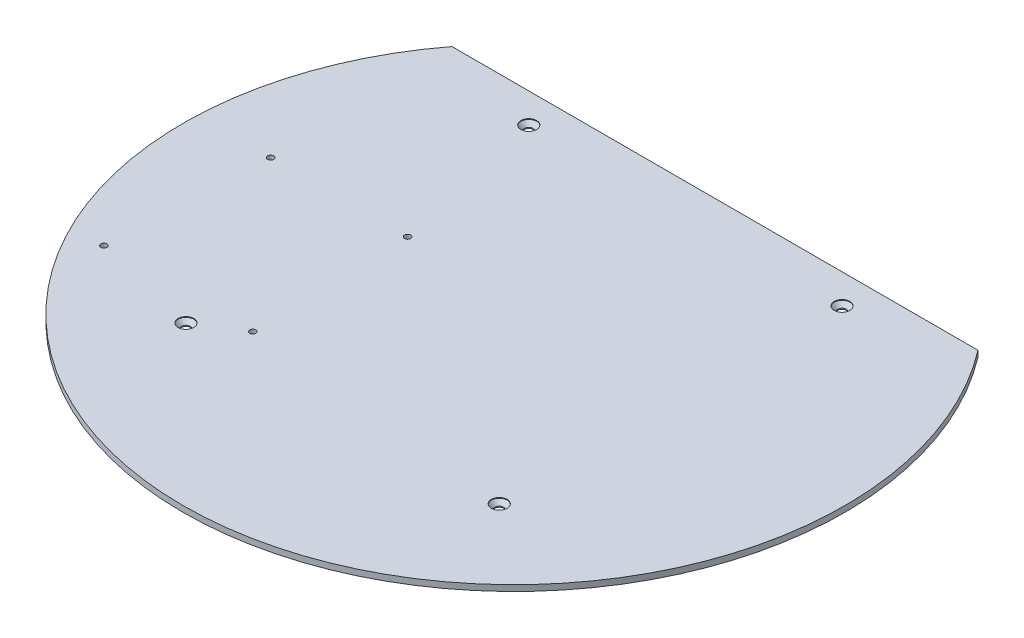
ISO-10303-21;
HEADER;
FILE_DESCRIPTION(('STEP AP214'),'2;1');
FILE_NAME('part.step','',(''),(''),'','','');
FILE_SCHEMA(('AUTOMOTIVE_DESIGN { 1 0 10303 214 1 1 1 1 }'));
ENDSEC;
DATA;
#1=APPLICATION_CONTEXT('core data for automotive mechanical design processes');
#2=APPLICATION_PROTOCOL_DEFINITION('international standard','automotive_design',2000,#1);
#3=PRODUCT_CONTEXT('',#1,'mechanical');
#4=PRODUCT('Part','Part','',(#3));
#5=PRODUCT_RELATED_PRODUCT_CATEGORY('part','',(#4));
#6=PRODUCT_DEFINITION_FORMATION('','',#4);
#7=PRODUCT_DEFINITION_CONTEXT('part definition',#1,'design');
#8=PRODUCT_DEFINITION('design','',#6,#7);
#9=PRODUCT_DEFINITION_SHAPE('','',#8);
#10=(LENGTH_UNIT() NAMED_UNIT(*) SI_UNIT(.MILLI.,.METRE.));
#11=(NAMED_UNIT(*) PLANE_ANGLE_UNIT() SI_UNIT($,.RADIAN.));
#12=(NAMED_UNIT(*) SI_UNIT($,.STERADIAN.) SOLID_ANGLE_UNIT());
#13=UNCERTAINTY_MEASURE_WITH_UNIT(LENGTH_MEASURE(1.E-05),#10,'distance_accuracy_value','');
#14=(GEOMETRIC_REPRESENTATION_CONTEXT(3) GLOBAL_UNCERTAINTY_ASSIGNED_CONTEXT((#13)) GLOBAL_UNIT_ASSIGNED_CONTEXT((#10,
#11,#12)) REPRESENTATION_CONTEXT('',''));
#15=CARTESIAN_POINT('',(0.,0.,0.));
#16=DIRECTION('',(0.,0.,1.));
#17=DIRECTION('',(1.,0.,0.));
#18=AXIS2_PLACEMENT_3D('',#15,#16,#17);
#19=CARTESIAN_POINT('',(0.,3.175,0.));
#20=DIRECTION('',(0.,-1.,0.));
#21=DIRECTION('',(0.,0.,-1.));
#22=AXIS2_PLACEMENT_3D('',#19,#20,#21);
#23=CYLINDRICAL_SURFACE('',#22,177.8);
#24=CARTESIAN_POINT('',(0.,0.,0.));
#25=DIRECTION('',(0.,1.,0.));
#26=DIRECTION('',(0.,0.,1.));
#27=AXIS2_PLACEMENT_3D('',#24,#25,#26);
#28=CIRCLE('',#27,177.8);
#29=CARTESIAN_POINT('',(-141.278581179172,0.,-107.95));
#30=VERTEX_POINT('',#29);
#31=CARTESIAN_POINT('',(141.278581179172,0.,-107.95));
#32=VERTEX_POINT('',#31);
#33=EDGE_CURVE('E61',#30,#32,#28,.T.);
#34=ORIENTED_EDGE('',*,*,#33,.T.);
#35=DIRECTION('',(0.,-1.,0.));
#36=VECTOR('',#35,1.);
#37=CARTESIAN_POINT('',(141.278581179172,3.17499999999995,-107.95));
#38=LINE('',#37,#36);
#39=CARTESIAN_POINT('',(141.278581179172,3.17499999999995,-107.95));
#40=VERTEX_POINT('',#39);
#41=EDGE_CURVE('E11',#40,#32,#38,.T.);
#42=ORIENTED_EDGE('',*,*,#41,.F.);
#43=CARTESIAN_POINT('',(0.,3.175,0.));
#44=DIRECTION('',(0.,1.,0.));
#45=DIRECTION('',(0.,0.,1.));
#46=AXIS2_PLACEMENT_3D('',#43,#44,#45);
#47=CIRCLE('',#46,177.8);
#48=CARTESIAN_POINT('',(-141.278581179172,3.17500000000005,-107.95));
#49=VERTEX_POINT('',#48);
#50=EDGE_CURVE('E63',#49,#40,#47,.T.);
#51=ORIENTED_EDGE('',*,*,#50,.F.);
#52=DIRECTION('',(0.,-1.,0.));
#53=VECTOR('',#52,1.);
#54=CARTESIAN_POINT('',(-141.278581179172,3.17500000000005,-107.95));
#55=LINE('',#54,#53);
#56=EDGE_CURVE('E41',#49,#30,#55,.T.);
#57=ORIENTED_EDGE('',*,*,#56,.T.);
#58=EDGE_LOOP('',(#34,#42,#51,#57));
#59=FACE_BOUND('',#58,.T.);
#60=ADVANCED_FACE('F34',(#59),#23,.T.);
#61=CARTESIAN_POINT('',(141.278581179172,3.17499999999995,-107.95));
#62=DIRECTION('',(0.,0.,1.));
#63=DIRECTION('',(1.,0.,0.));
#64=AXIS2_PLACEMENT_3D('',#61,#62,#63);
#65=PLANE('',#64);
#66=DIRECTION('',(-1.,0.,0.));
#67=VECTOR('',#66,1.);
#68=CARTESIAN_POINT('',(141.278581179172,0.,-107.95));
#69=LINE('',#68,#67);
#70=EDGE_CURVE('E58',#32,#30,#69,.T.);
#71=ORIENTED_EDGE('',*,*,#70,.T.);
#72=ORIENTED_EDGE('',*,*,#56,.F.);
#73=DIRECTION('',(-1.,0.,0.));
#74=VECTOR('',#73,1.);
#75=CARTESIAN_POINT('',(141.278581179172,3.17499999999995,-107.95));
#76=LINE('',#75,#74);
#77=EDGE_CURVE('E47',#40,#49,#76,.T.);
#78=ORIENTED_EDGE('',*,*,#77,.F.);
#79=ORIENTED_EDGE('',*,*,#41,.T.);
#80=EDGE_LOOP('',(#71,#72,#78,#79));
#81=FACE_BOUND('',#80,.T.);
#82=ADVANCED_FACE('F66',(#81),#65,.F.);
#83=CARTESIAN_POINT('',(0.,3.175,0.));
#84=DIRECTION('',(0.,1.,0.));
#85=DIRECTION('',(0.,0.,1.));
#86=AXIS2_PLACEMENT_3D('',#83,#84,#85);
#87=PLANE('',#86);
#88=CARTESIAN_POINT('',(-64.6742549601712,3.17500000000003,-7.5865132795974));
#89=DIRECTION('',(0.,1.,0.));
#90=DIRECTION('',(-1.,0.,0.));
#91=AXIS2_PLACEMENT_3D('',#88,#89,#90);
#92=CIRCLE('',#91,1.65099999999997);
#93=CARTESIAN_POINT('',(-66.3252549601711,3.17500000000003,-7.5865132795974));
#94=VERTEX_POINT('',#93);
#95=EDGE_CURVE('E275',#94,#94,#92,.T.);
#96=ORIENTED_EDGE('',*,*,#95,.F.);
#97=EDGE_LOOP('',(#96));
#98=FACE_BOUND('',#97,.T.);
#99=CARTESIAN_POINT('',(-138.334254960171,3.17500000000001,-7.5865132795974));
#100=DIRECTION('',(0.,1.,0.));
#101=DIRECTION('',(-1.,0.,0.));
#102=AXIS2_PLACEMENT_3D('',#99,#100,#101);
#103=CIRCLE('',#102,1.65099999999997);
#104=CARTESIAN_POINT('',(-139.985254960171,3.17500000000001,-7.5865132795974));
#105=VERTEX_POINT('',#104);
#106=EDGE_CURVE('E277',#105,#105,#103,.T.);
#107=ORIENTED_EDGE('',*,*,#106,.F.);
#108=EDGE_LOOP('',(#107));
#109=FACE_BOUND('',#108,.T.);
#110=CARTESIAN_POINT('',(-62.1342549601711,3.17499999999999,78.1384867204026));
#111=DIRECTION('',(0.,1.,0.));
#112=DIRECTION('',(-1.,0.,0.));
#113=AXIS2_PLACEMENT_3D('',#110,#111,#112);
#114=CIRCLE('',#113,1.65099999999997);
#115=CARTESIAN_POINT('',(-63.7852549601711,3.17499999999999,78.1384867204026));
#116=VERTEX_POINT('',#115);
#117=EDGE_CURVE('E285',#116,#116,#114,.T.);
#118=ORIENTED_EDGE('',*,*,#117,.F.);
#119=EDGE_LOOP('',(#118));
#120=FACE_BOUND('',#119,.T.);
#121=CARTESIAN_POINT('',(-142.144254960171,3.17500000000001,78.1384867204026));
#122=DIRECTION('',(0.,1.,0.));
#123=DIRECTION('',(-1.,0.,0.));
#124=AXIS2_PLACEMENT_3D('',#121,#122,#123);
#125=CIRCLE('',#124,1.65099999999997);
#126=CARTESIAN_POINT('',(-143.795254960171,3.17500000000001,78.1384867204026));
#127=VERTEX_POINT('',#126);
#128=EDGE_CURVE('E291',#127,#127,#125,.T.);
#129=ORIENTED_EDGE('',*,*,#128,.F.);
#130=EDGE_LOOP('',(#129));
#131=FACE_BOUND('',#130,.T.);
#132=CARTESIAN_POINT('',(-84.1375,3.17500000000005,-92.075));
#133=DIRECTION('',(0.,1.,0.));
#134=DIRECTION('',(0.,0.,1.));
#135=AXIS2_PLACEMENT_3D('',#132,#133,#134);
#136=CIRCLE('',#135,4.21640000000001);
#137=CARTESIAN_POINT('',(-84.1375,3.17500000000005,-87.8586));
#138=VERTEX_POINT('',#137);
#139=EDGE_CURVE('E297',#138,#138,#136,.T.);
#140=ORIENTED_EDGE('',*,*,#139,.F.);
#141=EDGE_LOOP('',(#140));
#142=FACE_BOUND('',#141,.T.);
#143=CARTESIAN_POINT('',(84.1375,3.17499999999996,-92.075));
#144=DIRECTION('',(0.,1.,0.));
#145=DIRECTION('',(0.,0.,1.));
#146=AXIS2_PLACEMENT_3D('',#143,#144,#145);
#147=CIRCLE('',#146,4.21640000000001);
#148=CARTESIAN_POINT('',(84.1375,3.17499999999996,-87.8586));
#149=VERTEX_POINT('',#148);
#150=EDGE_CURVE('E309',#149,#149,#147,.T.);
#151=ORIENTED_EDGE('',*,*,#150,.F.);
#152=EDGE_LOOP('',(#151));
#153=FACE_BOUND('',#152,.T.);
#154=CARTESIAN_POINT('',(84.1375,3.17499999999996,92.075));
#155=DIRECTION('',(0.,1.,0.));
#156=DIRECTION('',(0.,0.,1.));
#157=AXIS2_PLACEMENT_3D('',#154,#155,#156);
#158=CIRCLE('',#157,4.21639999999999);
#159=CARTESIAN_POINT('',(84.1375,3.17499999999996,96.2914));
#160=VERTEX_POINT('',#159);
#161=EDGE_CURVE('E321',#160,#160,#158,.T.);
#162=ORIENTED_EDGE('',*,*,#161,.F.);
#163=EDGE_LOOP('',(#162));
#164=FACE_BOUND('',#163,.T.);
#165=CARTESIAN_POINT('',(-84.1375,3.17500000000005,92.075));
#166=DIRECTION('',(0.,1.,0.));
#167=DIRECTION('',(0.,0.,1.));
#168=AXIS2_PLACEMENT_3D('',#165,#166,#167);
#169=CIRCLE('',#168,4.21640000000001);
#170=CARTESIAN_POINT('',(-84.1375,3.17500000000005,96.2914));
#171=VERTEX_POINT('',#170);
#172=EDGE_CURVE('E333',#171,#171,#169,.T.);
#173=ORIENTED_EDGE('',*,*,#172,.F.);
#174=EDGE_LOOP('',(#173));
#175=FACE_BOUND('',#174,.T.);
#176=ORIENTED_EDGE('',*,*,#50,.T.);
#177=ORIENTED_EDGE('',*,*,#77,.T.);
#178=EDGE_LOOP('',(#176,#177));
#179=FACE_BOUND('',#178,.T.);
#180=ADVANCED_FACE('F77',(#98,#109,#120,#131,#142,#153,#164,#175,#179),#87,.T.);
#181=CARTESIAN_POINT('',(0.,0.,0.));
#182=DIRECTION('',(0.,1.,0.));
#183=DIRECTION('',(0.,0.,1.));
#184=AXIS2_PLACEMENT_3D('',#181,#182,#183);
#185=PLANE('',#184);
#186=CARTESIAN_POINT('',(-64.6742549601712,0.,-7.5865132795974));
#187=DIRECTION('',(0.,1.,0.));
#188=DIRECTION('',(-1.,0.,0.));
#189=AXIS2_PLACEMENT_3D('',#186,#187,#188);
#190=CIRCLE('',#189,1.65099999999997);
#191=CARTESIAN_POINT('',(-66.3252549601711,0.,-7.5865132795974));
#192=VERTEX_POINT('',#191);
#193=EDGE_CURVE('E273',#192,#192,#190,.T.);
#194=ORIENTED_EDGE('',*,*,#193,.T.);
#195=EDGE_LOOP('',(#194));
#196=FACE_BOUND('',#195,.T.);
#197=CARTESIAN_POINT('',(-138.334254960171,0.,-7.5865132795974));
#198=DIRECTION('',(0.,1.,0.));
#199=DIRECTION('',(-1.,0.,0.));
#200=AXIS2_PLACEMENT_3D('',#197,#198,#199);
#201=CIRCLE('',#200,1.65099999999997);
#202=CARTESIAN_POINT('',(-139.985254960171,0.,-7.5865132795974));
#203=VERTEX_POINT('',#202);
#204=EDGE_CURVE('E282',#203,#203,#201,.T.);
#205=ORIENTED_EDGE('',*,*,#204,.T.);
#206=EDGE_LOOP('',(#205));
#207=FACE_BOUND('',#206,.T.);
#208=CARTESIAN_POINT('',(-62.1342549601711,0.,78.1384867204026));
#209=DIRECTION('',(0.,1.,0.));
#210=DIRECTION('',(-1.,0.,0.));
#211=AXIS2_PLACEMENT_3D('',#208,#209,#210);
#212=CIRCLE('',#211,1.65099999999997);
#213=CARTESIAN_POINT('',(-63.7852549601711,0.,78.1384867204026));
#214=VERTEX_POINT('',#213);
#215=EDGE_CURVE('E288',#214,#214,#212,.T.);
#216=ORIENTED_EDGE('',*,*,#215,.T.);
#217=EDGE_LOOP('',(#216));
#218=FACE_BOUND('',#217,.T.);
#219=CARTESIAN_POINT('',(-142.144254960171,0.,78.1384867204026));
#220=DIRECTION('',(0.,1.,0.));
#221=DIRECTION('',(-1.,0.,0.));
#222=AXIS2_PLACEMENT_3D('',#219,#220,#221);
#223=CIRCLE('',#222,1.65099999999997);
#224=CARTESIAN_POINT('',(-143.795254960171,0.,78.1384867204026));
#225=VERTEX_POINT('',#224);
#226=EDGE_CURVE('E294',#225,#225,#223,.T.);
#227=ORIENTED_EDGE('',*,*,#226,.T.);
#228=EDGE_LOOP('',(#227));
#229=FACE_BOUND('',#228,.T.);
#230=CARTESIAN_POINT('',(-84.1375,0.,-92.075));
#231=DIRECTION('',(0.,1.,0.));
#232=DIRECTION('',(0.,0.,1.));
#233=AXIS2_PLACEMENT_3D('',#230,#231,#232);
#234=CIRCLE('',#233,2.2479);
#235=CARTESIAN_POINT('',(-84.1375,0.,-89.8271));
#236=VERTEX_POINT('',#235);
#237=EDGE_CURVE('E306',#236,#236,#234,.T.);
#238=ORIENTED_EDGE('',*,*,#237,.T.);
#239=EDGE_LOOP('',(#238));
#240=FACE_BOUND('',#239,.T.);
#241=CARTESIAN_POINT('',(84.1375,0.,-92.075));
#242=DIRECTION('',(0.,1.,0.));
#243=DIRECTION('',(0.,0.,1.));
#244=AXIS2_PLACEMENT_3D('',#241,#242,#243);
#245=CIRCLE('',#244,2.2479);
#246=CARTESIAN_POINT('',(84.1375,0.,-89.8271));
#247=VERTEX_POINT('',#246);
#248=EDGE_CURVE('E318',#247,#247,#245,.T.);
#249=ORIENTED_EDGE('',*,*,#248,.T.);
#250=EDGE_LOOP('',(#249));
#251=FACE_BOUND('',#250,.T.);
#252=CARTESIAN_POINT('',(84.1375,0.,92.075));
#253=DIRECTION('',(0.,1.,0.));
#254=DIRECTION('',(0.,0.,1.));
#255=AXIS2_PLACEMENT_3D('',#252,#253,#254);
#256=CIRCLE('',#255,2.2479);
#257=CARTESIAN_POINT('',(84.1375,0.,94.3229));
#258=VERTEX_POINT('',#257);
#259=EDGE_CURVE('E330',#258,#258,#256,.T.);
#260=ORIENTED_EDGE('',*,*,#259,.T.);
#261=EDGE_LOOP('',(#260));
#262=FACE_BOUND('',#261,.T.);
#263=CARTESIAN_POINT('',(-84.1375,0.,92.075));
#264=DIRECTION('',(0.,1.,0.));
#265=DIRECTION('',(0.,0.,1.));
#266=AXIS2_PLACEMENT_3D('',#263,#264,#265);
#267=CIRCLE('',#266,2.2479);
#268=CARTESIAN_POINT('',(-84.1375,0.,94.3229));
#269=VERTEX_POINT('',#268);
#270=EDGE_CURVE('E69',#269,#269,#267,.T.);
#271=ORIENTED_EDGE('',*,*,#270,.T.);
#272=EDGE_LOOP('',(#271));
#273=FACE_BOUND('',#272,.T.);
#274=ORIENTED_EDGE('',*,*,#33,.F.);
#275=ORIENTED_EDGE('',*,*,#70,.F.);
#276=EDGE_LOOP('',(#274,#275));
#277=FACE_BOUND('',#276,.T.);
#278=ADVANCED_FACE('F59',(#196,#207,#218,#229,#240,#251,#262,#273,#277),#185,.F.);
#279=CARTESIAN_POINT('',(-84.1375,3.17500000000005,92.075));
#280=DIRECTION('',(0.,1.,0.));
#281=DIRECTION('',(0.,0.,1.));
#282=AXIS2_PLACEMENT_3D('',#279,#280,#281);
#283=CYLINDRICAL_SURFACE('',#282,2.2479);
#284=ORIENTED_EDGE('',*,*,#270,.F.);
#285=EDGE_LOOP('',(#284));
#286=FACE_BOUND('',#285,.T.);
#287=CARTESIAN_POINT('',(-84.1375,0.529499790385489,92.075));
#288=DIRECTION('',(0.,1.,0.));
#289=DIRECTION('',(0.,0.,1.));
#290=AXIS2_PLACEMENT_3D('',#287,#288,#289);
#291=CIRCLE('',#290,2.24790000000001);
#292=CARTESIAN_POINT('',(-84.1375,0.529499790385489,94.3229));
#293=VERTEX_POINT('',#292);
#294=EDGE_CURVE('E72',#293,#293,#291,.T.);
#295=ORIENTED_EDGE('',*,*,#294,.T.);
#296=EDGE_LOOP('',(#295));
#297=FACE_BOUND('',#296,.T.);
#298=ADVANCED_FACE('F85',(#286,#297),#283,.F.);
#299=CARTESIAN_POINT('',(-84.1375,2.79400000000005,92.075));
#300=DIRECTION('',(0.,1.,0.));
#301=DIRECTION('',(0.,0.,1.));
#302=AXIS2_PLACEMENT_3D('',#299,#300,#301);
#303=CONICAL_SURFACE('',#302,4.21639999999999,0.715584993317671);
#304=ORIENTED_EDGE('',*,*,#294,.F.);
#305=EDGE_LOOP('',(#304));
#306=FACE_BOUND('',#305,.T.);
#307=CARTESIAN_POINT('',(-84.1375,2.79400000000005,92.075));
#308=DIRECTION('',(0.,1.,0.));
#309=DIRECTION('',(0.,0.,1.));
#310=AXIS2_PLACEMENT_3D('',#307,#308,#309);
#311=CIRCLE('',#310,4.21639999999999);
#312=CARTESIAN_POINT('',(-84.1375,2.79400000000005,96.2914));
#313=VERTEX_POINT('',#312);
#314=EDGE_CURVE('E336',#313,#313,#311,.T.);
#315=ORIENTED_EDGE('',*,*,#314,.T.);
#316=EDGE_LOOP('',(#315));
#317=FACE_BOUND('',#316,.T.);
#318=ADVANCED_FACE('F116',(#306,#317),#303,.F.);
#319=CARTESIAN_POINT('',(-84.1375,3.17500000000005,92.075));
#320=DIRECTION('',(0.,1.,0.));
#321=DIRECTION('',(0.,0.,1.));
#322=AXIS2_PLACEMENT_3D('',#319,#320,#321);
#323=CYLINDRICAL_SURFACE('',#322,4.2164);
#324=ORIENTED_EDGE('',*,*,#314,.F.);
#325=EDGE_LOOP('',(#324));
#326=FACE_BOUND('',#325,.T.);
#327=ORIENTED_EDGE('',*,*,#172,.T.);
#328=EDGE_LOOP('',(#327));
#329=FACE_BOUND('',#328,.T.);
#330=ADVANCED_FACE('F126',(#326,#329),#323,.F.);
#331=CARTESIAN_POINT('',(84.1375,3.17499999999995,92.075));
#332=DIRECTION('',(0.,1.,0.));
#333=DIRECTION('',(0.,0.,1.));
#334=AXIS2_PLACEMENT_3D('',#331,#332,#333);
#335=CYLINDRICAL_SURFACE('',#334,2.2479);
#336=ORIENTED_EDGE('',*,*,#259,.F.);
#337=EDGE_LOOP('',(#336));
#338=FACE_BOUND('',#337,.T.);
#339=CARTESIAN_POINT('',(84.1375,0.529499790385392,92.075));
#340=DIRECTION('',(0.,1.,0.));
#341=DIRECTION('',(0.,0.,1.));
#342=AXIS2_PLACEMENT_3D('',#339,#340,#341);
#343=CIRCLE('',#342,2.24790000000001);
#344=CARTESIAN_POINT('',(84.1375,0.529499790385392,94.3229));
#345=VERTEX_POINT('',#344);
#346=EDGE_CURVE('E327',#345,#345,#343,.T.);
#347=ORIENTED_EDGE('',*,*,#346,.T.);
#348=EDGE_LOOP('',(#347));
#349=FACE_BOUND('',#348,.T.);
#350=ADVANCED_FACE('F136',(#338,#349),#335,.F.);
#351=CARTESIAN_POINT('',(84.1375,2.79399999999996,92.075));
#352=DIRECTION('',(0.,1.,0.));
#353=DIRECTION('',(0.,0.,1.));
#354=AXIS2_PLACEMENT_3D('',#351,#352,#353);
#355=CONICAL_SURFACE('',#354,4.21639999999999,0.715584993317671);
#356=ORIENTED_EDGE('',*,*,#346,.F.);
#357=EDGE_LOOP('',(#356));
#358=FACE_BOUND('',#357,.T.);
#359=CARTESIAN_POINT('',(84.1375,2.79399999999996,92.075));
#360=DIRECTION('',(0.,1.,0.));
#361=DIRECTION('',(0.,0.,1.));
#362=AXIS2_PLACEMENT_3D('',#359,#360,#361);
#363=CIRCLE('',#362,4.21639999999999);
#364=CARTESIAN_POINT('',(84.1375,2.79399999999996,96.2914));
#365=VERTEX_POINT('',#364);
#366=EDGE_CURVE('E324',#365,#365,#363,.T.);
#367=ORIENTED_EDGE('',*,*,#366,.T.);
#368=EDGE_LOOP('',(#367));
#369=FACE_BOUND('',#368,.T.);
#370=ADVANCED_FACE('F146',(#358,#369),#355,.F.);
#371=CARTESIAN_POINT('',(84.1375,3.17499999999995,92.075));
#372=DIRECTION('',(0.,1.,0.));
#373=DIRECTION('',(0.,0.,1.));
#374=AXIS2_PLACEMENT_3D('',#371,#372,#373);
#375=CYLINDRICAL_SURFACE('',#374,4.21639999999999);
#376=ORIENTED_EDGE('',*,*,#366,.F.);
#377=EDGE_LOOP('',(#376));
#378=FACE_BOUND('',#377,.T.);
#379=ORIENTED_EDGE('',*,*,#161,.T.);
#380=EDGE_LOOP('',(#379));
#381=FACE_BOUND('',#380,.T.);
#382=ADVANCED_FACE('F156',(#378,#381),#375,.F.);
#383=CARTESIAN_POINT('',(84.1375,3.17499999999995,-92.075));
#384=DIRECTION('',(0.,1.,0.));
#385=DIRECTION('',(0.,0.,1.));
#386=AXIS2_PLACEMENT_3D('',#383,#384,#385);
#387=CYLINDRICAL_SURFACE('',#386,2.2479);
#388=ORIENTED_EDGE('',*,*,#248,.F.);
#389=EDGE_LOOP('',(#388));
#390=FACE_BOUND('',#389,.T.);
#391=CARTESIAN_POINT('',(84.1375,0.529499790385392,-92.075));
#392=DIRECTION('',(0.,1.,0.));
#393=DIRECTION('',(0.,0.,1.));
#394=AXIS2_PLACEMENT_3D('',#391,#392,#393);
#395=CIRCLE('',#394,2.24790000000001);
#396=CARTESIAN_POINT('',(84.1375,0.529499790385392,-89.8271));
#397=VERTEX_POINT('',#396);
#398=EDGE_CURVE('E315',#397,#397,#395,.T.);
#399=ORIENTED_EDGE('',*,*,#398,.T.);
#400=EDGE_LOOP('',(#399));
#401=FACE_BOUND('',#400,.T.);
#402=ADVANCED_FACE('F166',(#390,#401),#387,.F.);
#403=CARTESIAN_POINT('',(84.1375,2.79399999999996,-92.075));
#404=DIRECTION('',(0.,1.,0.));
#405=DIRECTION('',(0.,0.,1.));
#406=AXIS2_PLACEMENT_3D('',#403,#404,#405);
#407=CONICAL_SURFACE('',#406,4.21639999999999,0.715584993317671);
#408=ORIENTED_EDGE('',*,*,#398,.F.);
#409=EDGE_LOOP('',(#408));
#410=FACE_BOUND('',#409,.T.);
#411=CARTESIAN_POINT('',(84.1375,2.79399999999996,-92.075));
#412=DIRECTION('',(0.,1.,0.));
#413=DIRECTION('',(0.,0.,1.));
#414=AXIS2_PLACEMENT_3D('',#411,#412,#413);
#415=CIRCLE('',#414,4.21639999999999);
#416=CARTESIAN_POINT('',(84.1375,2.79399999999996,-87.8586));
#417=VERTEX_POINT('',#416);
#418=EDGE_CURVE('E312',#417,#417,#415,.T.);
#419=ORIENTED_EDGE('',*,*,#418,.T.);
#420=EDGE_LOOP('',(#419));
#421=FACE_BOUND('',#420,.T.);
#422=ADVANCED_FACE('F176',(#410,#421),#407,.F.);
#423=CARTESIAN_POINT('',(84.1375,3.17499999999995,-92.075));
#424=DIRECTION('',(0.,1.,0.));
#425=DIRECTION('',(0.,0.,1.));
#426=AXIS2_PLACEMENT_3D('',#423,#424,#425);
#427=CYLINDRICAL_SURFACE('',#426,4.2164);
#428=ORIENTED_EDGE('',*,*,#418,.F.);
#429=EDGE_LOOP('',(#428));
#430=FACE_BOUND('',#429,.T.);
#431=ORIENTED_EDGE('',*,*,#150,.T.);
#432=EDGE_LOOP('',(#431));
#433=FACE_BOUND('',#432,.T.);
#434=ADVANCED_FACE('F186',(#430,#433),#427,.F.);
#435=CARTESIAN_POINT('',(-84.1375,3.17500000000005,-92.075));
#436=DIRECTION('',(0.,1.,0.));
#437=DIRECTION('',(0.,0.,1.));
#438=AXIS2_PLACEMENT_3D('',#435,#436,#437);
#439=CYLINDRICAL_SURFACE('',#438,2.2479);
#440=ORIENTED_EDGE('',*,*,#237,.F.);
#441=EDGE_LOOP('',(#440));
#442=FACE_BOUND('',#441,.T.);
#443=CARTESIAN_POINT('',(-84.1375,0.529499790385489,-92.075));
#444=DIRECTION('',(0.,1.,0.));
#445=DIRECTION('',(0.,0.,1.));
#446=AXIS2_PLACEMENT_3D('',#443,#444,#445);
#447=CIRCLE('',#446,2.24790000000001);
#448=CARTESIAN_POINT('',(-84.1375,0.529499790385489,-89.8271));
#449=VERTEX_POINT('',#448);
#450=EDGE_CURVE('E303',#449,#449,#447,.T.);
#451=ORIENTED_EDGE('',*,*,#450,.T.);
#452=EDGE_LOOP('',(#451));
#453=FACE_BOUND('',#452,.T.);
#454=ADVANCED_FACE('F196',(#442,#453),#439,.F.);
#455=CARTESIAN_POINT('',(-84.1375,2.79400000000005,-92.075));
#456=DIRECTION('',(0.,1.,0.));
#457=DIRECTION('',(0.,0.,1.));
#458=AXIS2_PLACEMENT_3D('',#455,#456,#457);
#459=CONICAL_SURFACE('',#458,4.21639999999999,0.715584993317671);
#460=ORIENTED_EDGE('',*,*,#450,.F.);
#461=EDGE_LOOP('',(#460));
#462=FACE_BOUND('',#461,.T.);
#463=CARTESIAN_POINT('',(-84.1375,2.79400000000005,-92.075));
#464=DIRECTION('',(0.,1.,0.));
#465=DIRECTION('',(0.,0.,1.));
#466=AXIS2_PLACEMENT_3D('',#463,#464,#465);
#467=CIRCLE('',#466,4.21639999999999);
#468=CARTESIAN_POINT('',(-84.1375,2.79400000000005,-87.8586));
#469=VERTEX_POINT('',#468);
#470=EDGE_CURVE('E300',#469,#469,#467,.T.);
#471=ORIENTED_EDGE('',*,*,#470,.T.);
#472=EDGE_LOOP('',(#471));
#473=FACE_BOUND('',#472,.T.);
#474=ADVANCED_FACE('F206',(#462,#473),#459,.F.);
#475=CARTESIAN_POINT('',(-84.1375,3.17500000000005,-92.075));
#476=DIRECTION('',(0.,1.,0.));
#477=DIRECTION('',(0.,0.,1.));
#478=AXIS2_PLACEMENT_3D('',#475,#476,#477);
#479=CYLINDRICAL_SURFACE('',#478,4.2164);
#480=ORIENTED_EDGE('',*,*,#470,.F.);
#481=EDGE_LOOP('',(#480));
#482=FACE_BOUND('',#481,.T.);
#483=ORIENTED_EDGE('',*,*,#139,.T.);
#484=EDGE_LOOP('',(#483));
#485=FACE_BOUND('',#484,.T.);
#486=ADVANCED_FACE('F216',(#482,#485),#479,.F.);
#487=CARTESIAN_POINT('',(-142.144254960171,0.,78.1384867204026));
#488=DIRECTION('',(0.,1.,0.));
#489=DIRECTION('',(-1.,0.,0.));
#490=AXIS2_PLACEMENT_3D('',#487,#488,#489);
#491=CYLINDRICAL_SURFACE('',#490,1.65099999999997);
#492=ORIENTED_EDGE('',*,*,#226,.F.);
#493=EDGE_LOOP('',(#492));
#494=FACE_BOUND('',#493,.T.);
#495=ORIENTED_EDGE('',*,*,#128,.T.);
#496=EDGE_LOOP('',(#495));
#497=FACE_BOUND('',#496,.T.);
#498=ADVANCED_FACE('F226',(#494,#497),#491,.F.);
#499=CARTESIAN_POINT('',(-62.1342549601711,0.,78.1384867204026));
#500=DIRECTION('',(0.,1.,0.));
#501=DIRECTION('',(-1.,0.,0.));
#502=AXIS2_PLACEMENT_3D('',#499,#500,#501);
#503=CYLINDRICAL_SURFACE('',#502,1.65099999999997);
#504=ORIENTED_EDGE('',*,*,#215,.F.);
#505=EDGE_LOOP('',(#504));
#506=FACE_BOUND('',#505,.T.);
#507=ORIENTED_EDGE('',*,*,#117,.T.);
#508=EDGE_LOOP('',(#507));
#509=FACE_BOUND('',#508,.T.);
#510=ADVANCED_FACE('F236',(#506,#509),#503,.F.);
#511=CARTESIAN_POINT('',(-138.334254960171,0.,-7.5865132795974));
#512=DIRECTION('',(0.,1.,0.));
#513=DIRECTION('',(-1.,0.,0.));
#514=AXIS2_PLACEMENT_3D('',#511,#512,#513);
#515=CYLINDRICAL_SURFACE('',#514,1.65099999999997);
#516=ORIENTED_EDGE('',*,*,#204,.F.);
#517=EDGE_LOOP('',(#516));
#518=FACE_BOUND('',#517,.T.);
#519=ORIENTED_EDGE('',*,*,#106,.T.);
#520=EDGE_LOOP('',(#519));
#521=FACE_BOUND('',#520,.T.);
#522=ADVANCED_FACE('F246',(#518,#521),#515,.F.);
#523=CARTESIAN_POINT('',(-64.6742549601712,0.,-7.5865132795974));
#524=DIRECTION('',(0.,1.,0.));
#525=DIRECTION('',(-1.,0.,0.));
#526=AXIS2_PLACEMENT_3D('',#523,#524,#525);
#527=CYLINDRICAL_SURFACE('',#526,1.65099999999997);
#528=ORIENTED_EDGE('',*,*,#193,.F.);
#529=EDGE_LOOP('',(#528));
#530=FACE_BOUND('',#529,.T.);
#531=ORIENTED_EDGE('',*,*,#95,.T.);
#532=EDGE_LOOP('',(#531));
#533=FACE_BOUND('',#532,.T.);
#534=ADVANCED_FACE('F256',(#530,#533),#527,.F.);
#535=CLOSED_SHELL('',(#60,#82,#180,#278,#298,#318,#330,#350,#370,#382,#402,#422,#434,#454,#474,
#486,#498,#510,#522,#534));
#536=MANIFOLD_SOLID_BREP('B2',#535);
#537=ADVANCED_BREP_SHAPE_REPRESENTATION('',(#18,#536),#14);
#538=SHAPE_DEFINITION_REPRESENTATION(#9,#537);
ENDSEC;
END-ISO-10303-21;
